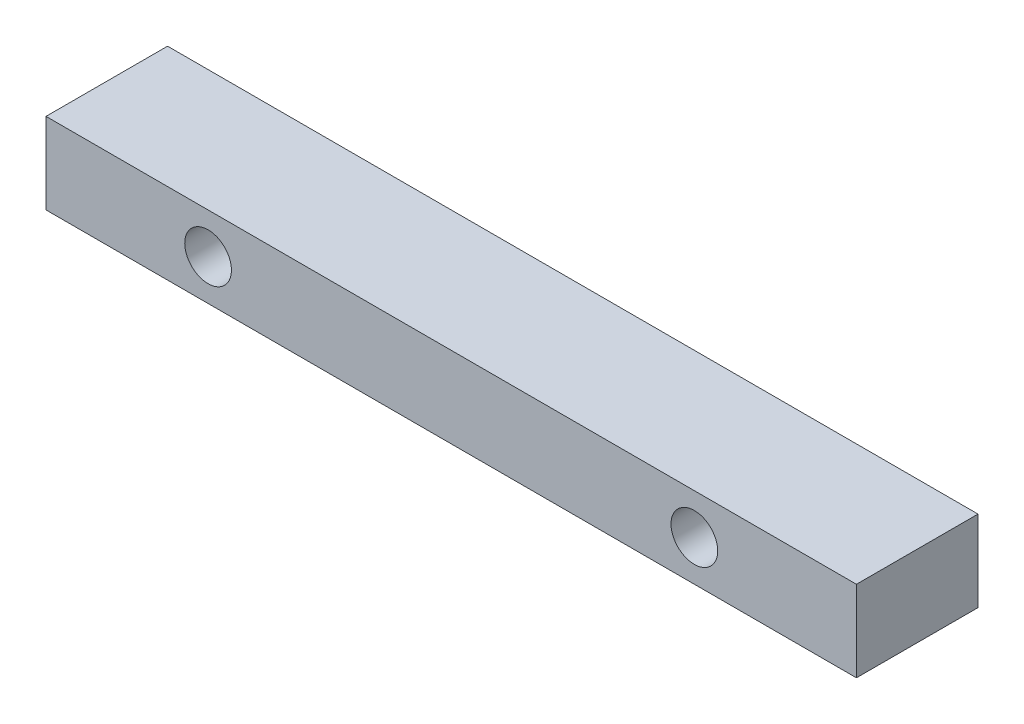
from build123d import *

# Parameters (mm, degrees)
SKETCH1_W           = 63.5
SKETCH1_H           = 6.35
SKETCH1_R           = 1.8288
BOSS_EXTRUDE1_DEPTH = 9.525


with BuildPart() as part:
    # Sketch1 → Boss-Extrude1 (new body)
    with BuildSketch(Plane.XY):
        with Locations((-31.75, 3.175)):
            Rectangle(SKETCH1_W, SKETCH1_H)
        with Locations(Location((-50.8, 3.175, 0), (0, 0, 180))):
            Circle(SKETCH1_R, mode=Mode.SUBTRACT)
        with Locations(Location((-12.7, 3.175, 0), (0, 0, 180))):
            Circle(SKETCH1_R, mode=Mode.SUBTRACT)
    extrude(amount=BOSS_EXTRUDE1_DEPTH)


solid = part.part
